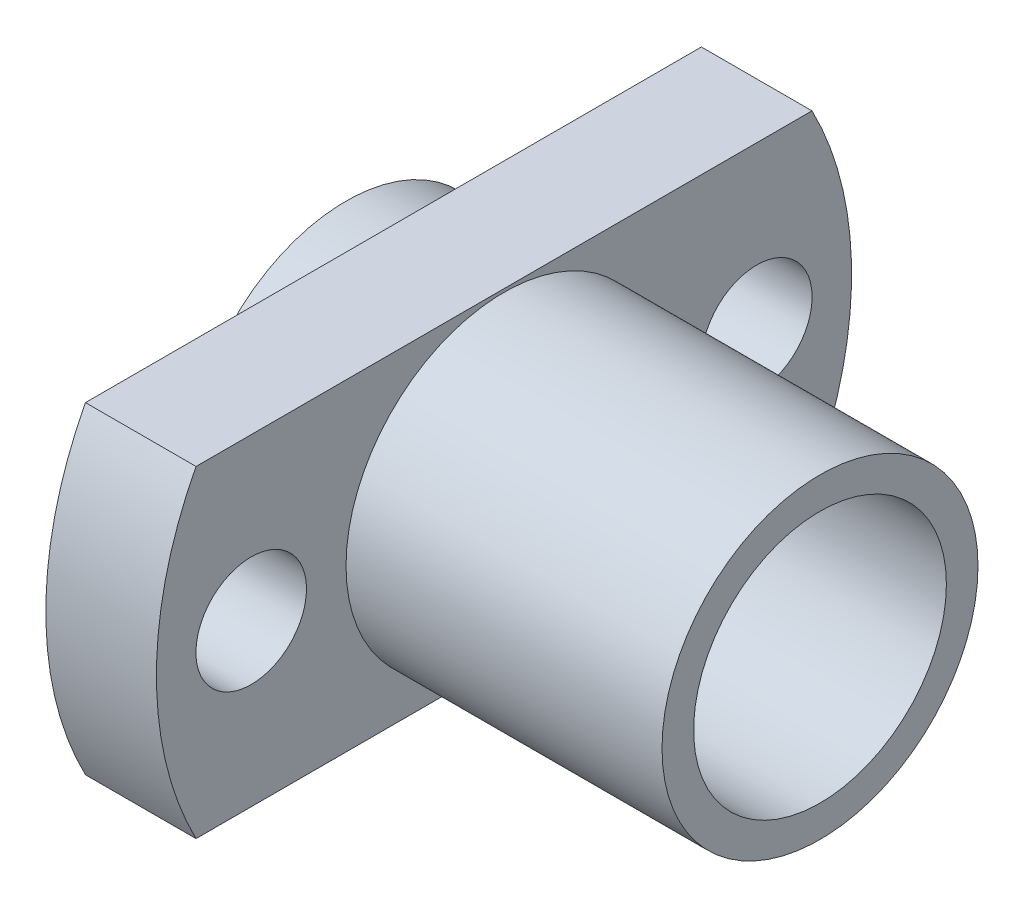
ISO-10303-21;
HEADER;
FILE_DESCRIPTION(('STEP AP214'),'2;1');
FILE_NAME('part.step','',(''),(''),'','','');
FILE_SCHEMA(('AUTOMOTIVE_DESIGN { 1 0 10303 214 1 1 1 1 }'));
ENDSEC;
DATA;
#1=APPLICATION_CONTEXT('core data for automotive mechanical design processes');
#2=APPLICATION_PROTOCOL_DEFINITION('international standard','automotive_design',2000,#1);
#3=PRODUCT_CONTEXT('',#1,'mechanical');
#4=PRODUCT('Part','Part','',(#3));
#5=PRODUCT_RELATED_PRODUCT_CATEGORY('part','',(#4));
#6=PRODUCT_DEFINITION_FORMATION('','',#4);
#7=PRODUCT_DEFINITION_CONTEXT('part definition',#1,'design');
#8=PRODUCT_DEFINITION('design','',#6,#7);
#9=PRODUCT_DEFINITION_SHAPE('','',#8);
#10=(LENGTH_UNIT() NAMED_UNIT(*) SI_UNIT(.MILLI.,.METRE.));
#11=(NAMED_UNIT(*) PLANE_ANGLE_UNIT() SI_UNIT($,.RADIAN.));
#12=(NAMED_UNIT(*) SI_UNIT($,.STERADIAN.) SOLID_ANGLE_UNIT());
#13=UNCERTAINTY_MEASURE_WITH_UNIT(LENGTH_MEASURE(1.E-05),#10,'distance_accuracy_value','');
#14=(GEOMETRIC_REPRESENTATION_CONTEXT(3) GLOBAL_UNCERTAINTY_ASSIGNED_CONTEXT((#13)) GLOBAL_UNIT_ASSIGNED_CONTEXT((#10,
#11,#12)) REPRESENTATION_CONTEXT('',''));
#15=CARTESIAN_POINT('',(0.,0.,0.));
#16=DIRECTION('',(0.,0.,1.));
#17=DIRECTION('',(1.,0.,0.));
#18=AXIS2_PLACEMENT_3D('',#15,#16,#17);
#19=CARTESIAN_POINT('',(5.,0.,0.));
#20=DIRECTION('',(1.,0.,0.));
#21=DIRECTION('',(0.,0.,-1.));
#22=AXIS2_PLACEMENT_3D('',#19,#20,#21);
#23=PLANE('',#22);
#24=CARTESIAN_POINT('',(5.,0.,-8.));
#25=DIRECTION('',(1.,0.,0.));
#26=DIRECTION('',(0.,0.,-1.));
#27=AXIS2_PLACEMENT_3D('',#24,#25,#26);
#28=CIRCLE('',#27,1.75);
#29=CARTESIAN_POINT('',(5.,0.,-9.75));
#30=VERTEX_POINT('',#29);
#31=EDGE_CURVE('E203',#30,#30,#28,.T.);
#32=ORIENTED_EDGE('',*,*,#31,.F.);
#33=EDGE_LOOP('',(#32));
#34=FACE_BOUND('',#33,.T.);
#35=CARTESIAN_POINT('',(5.,0.,0.));
#36=DIRECTION('',(1.,0.,0.));
#37=DIRECTION('',(0.,0.,-1.));
#38=AXIS2_PLACEMENT_3D('',#35,#36,#37);
#39=CIRCLE('',#38,11.);
#40=CARTESIAN_POINT('',(5.,5.1,9.74628134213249));
#41=VERTEX_POINT('',#40);
#42=CARTESIAN_POINT('',(5.,-5.1,9.74628134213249));
#43=VERTEX_POINT('',#42);
#44=EDGE_CURVE('E93',#41,#43,#39,.T.);
#45=ORIENTED_EDGE('',*,*,#44,.T.);
#46=DIRECTION('',(0.,0.,-1.));
#47=VECTOR('',#46,1.);
#48=CARTESIAN_POINT('',(5.,-5.1,9.74628134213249));
#49=LINE('',#48,#47);
#50=CARTESIAN_POINT('',(5.,-5.1,-9.74628134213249));
#51=VERTEX_POINT('',#50);
#52=EDGE_CURVE('E88',#43,#51,#49,.T.);
#53=ORIENTED_EDGE('',*,*,#52,.T.);
#54=CARTESIAN_POINT('',(5.,0.,0.));
#55=DIRECTION('',(1.,0.,0.));
#56=DIRECTION('',(0.,0.,-1.));
#57=AXIS2_PLACEMENT_3D('',#54,#55,#56);
#58=CIRCLE('',#57,11.);
#59=CARTESIAN_POINT('',(5.,5.1,-9.74628134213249));
#60=VERTEX_POINT('',#59);
#61=EDGE_CURVE('E91',#51,#60,#58,.T.);
#62=ORIENTED_EDGE('',*,*,#61,.T.);
#63=DIRECTION('',(0.,0.,1.));
#64=VECTOR('',#63,1.);
#65=CARTESIAN_POINT('',(5.,5.1,9.74628134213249));
#66=LINE('',#65,#64);
#67=EDGE_CURVE('E57',#60,#41,#66,.T.);
#68=ORIENTED_EDGE('',*,*,#67,.T.);
#69=EDGE_LOOP('',(#45,#53,#62,#68));
#70=FACE_BOUND('',#69,.T.);
#71=CARTESIAN_POINT('',(5.,0.,8.));
#72=DIRECTION('',(1.,0.,0.));
#73=DIRECTION('',(0.,0.,-1.));
#74=AXIS2_PLACEMENT_3D('',#71,#72,#73);
#75=CIRCLE('',#74,1.75);
#76=CARTESIAN_POINT('',(5.,0.,6.25));
#77=VERTEX_POINT('',#76);
#78=EDGE_CURVE('E116',#77,#77,#75,.T.);
#79=ORIENTED_EDGE('',*,*,#78,.F.);
#80=EDGE_LOOP('',(#79));
#81=FACE_BOUND('',#80,.T.);
#82=CARTESIAN_POINT('',(5.,0.,0.));
#83=DIRECTION('',(1.,0.,0.));
#84=DIRECTION('',(0.,0.,-1.));
#85=AXIS2_PLACEMENT_3D('',#82,#83,#84);
#86=CIRCLE('',#85,5.);
#87=CARTESIAN_POINT('',(5.,0.,-5.));
#88=VERTEX_POINT('',#87);
#89=EDGE_CURVE('E194',#88,#88,#86,.T.);
#90=ORIENTED_EDGE('',*,*,#89,.F.);
#91=EDGE_LOOP('',(#90));
#92=FACE_BOUND('',#91,.T.);
#93=ADVANCED_FACE('F39',(#34,#70,#81,#92),#23,.T.);
#94=CARTESIAN_POINT('',(0.,0.,0.));
#95=DIRECTION('',(1.,0.,0.));
#96=DIRECTION('',(0.,0.,-1.));
#97=AXIS2_PLACEMENT_3D('',#94,#95,#96);
#98=PLANE('',#97);
#99=CARTESIAN_POINT('',(0.,0.,0.));
#100=DIRECTION('',(1.,0.,0.));
#101=DIRECTION('',(0.,0.,-1.));
#102=AXIS2_PLACEMENT_3D('',#99,#100,#101);
#103=CIRCLE('',#102,5.);
#104=CARTESIAN_POINT('',(0.,0.,-5.));
#105=VERTEX_POINT('',#104);
#106=EDGE_CURVE('E43',#105,#105,#103,.T.);
#107=ORIENTED_EDGE('',*,*,#106,.F.);
#108=EDGE_LOOP('',(#107));
#109=FACE_BOUND('',#108,.T.);
#110=CARTESIAN_POINT('',(0.,0.,0.));
#111=DIRECTION('',(1.,0.,0.));
#112=DIRECTION('',(0.,0.,-1.));
#113=AXIS2_PLACEMENT_3D('',#110,#111,#112);
#114=CIRCLE('',#113,4.);
#115=CARTESIAN_POINT('',(0.,0.,-4.));
#116=VERTEX_POINT('',#115);
#117=EDGE_CURVE('E129',#116,#116,#114,.T.);
#118=ORIENTED_EDGE('',*,*,#117,.T.);
#119=EDGE_LOOP('',(#118));
#120=FACE_BOUND('',#119,.T.);
#121=ADVANCED_FACE('F139',(#109,#120),#98,.F.);
#122=CARTESIAN_POINT('',(1.5,0.,0.));
#123=DIRECTION('',(-1.,0.,0.));
#124=DIRECTION('',(0.,0.,1.));
#125=AXIS2_PLACEMENT_3D('',#122,#123,#124);
#126=CYLINDRICAL_SURFACE('',#125,5.);
#127=CARTESIAN_POINT('',(1.5,0.,0.));
#128=DIRECTION('',(1.,0.,0.));
#129=DIRECTION('',(0.,0.,-1.));
#130=AXIS2_PLACEMENT_3D('',#127,#128,#129);
#131=CIRCLE('',#130,5.);
#132=CARTESIAN_POINT('',(1.5,0.,-5.));
#133=VERTEX_POINT('',#132);
#134=EDGE_CURVE('E11',#133,#133,#131,.T.);
#135=ORIENTED_EDGE('',*,*,#134,.F.);
#136=EDGE_LOOP('',(#135));
#137=FACE_BOUND('',#136,.T.);
#138=ORIENTED_EDGE('',*,*,#106,.T.);
#139=EDGE_LOOP('',(#138));
#140=FACE_BOUND('',#139,.T.);
#141=ADVANCED_FACE('F41',(#137,#140),#126,.T.);
#142=CARTESIAN_POINT('',(1.5,0.,0.));
#143=DIRECTION('',(-1.,0.,0.));
#144=DIRECTION('',(0.,0.,1.));
#145=AXIS2_PLACEMENT_3D('',#142,#143,#144);
#146=CYLINDRICAL_SURFACE('',#145,4.);
#147=ORIENTED_EDGE('',*,*,#117,.F.);
#148=EDGE_LOOP('',(#147));
#149=FACE_BOUND('',#148,.T.);
#150=CARTESIAN_POINT('',(15.,0.,0.));
#151=DIRECTION('',(1.,0.,0.));
#152=DIRECTION('',(0.,0.,-1.));
#153=AXIS2_PLACEMENT_3D('',#150,#151,#152);
#154=CIRCLE('',#153,4.);
#155=CARTESIAN_POINT('',(15.,0.,-4.));
#156=VERTEX_POINT('',#155);
#157=EDGE_CURVE('E191',#156,#156,#154,.T.);
#158=ORIENTED_EDGE('',*,*,#157,.T.);
#159=EDGE_LOOP('',(#158));
#160=FACE_BOUND('',#159,.T.);
#161=ADVANCED_FACE('F145',(#149,#160),#146,.F.);
#162=CARTESIAN_POINT('',(1.5,0.,0.));
#163=DIRECTION('',(1.,0.,0.));
#164=DIRECTION('',(0.,0.,-1.));
#165=AXIS2_PLACEMENT_3D('',#162,#163,#164);
#166=PLANE('',#165);
#167=ORIENTED_EDGE('',*,*,#134,.T.);
#168=EDGE_LOOP('',(#167));
#169=FACE_BOUND('',#168,.T.);
#170=CARTESIAN_POINT('',(1.5,0.,0.));
#171=DIRECTION('',(1.,0.,0.));
#172=DIRECTION('',(0.,0.,-1.));
#173=AXIS2_PLACEMENT_3D('',#170,#171,#172);
#174=CIRCLE('',#173,11.);
#175=CARTESIAN_POINT('',(1.5,5.1,9.74628134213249));
#176=VERTEX_POINT('',#175);
#177=CARTESIAN_POINT('',(1.5,-5.1,9.74628134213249));
#178=VERTEX_POINT('',#177);
#179=EDGE_CURVE('E112',#176,#178,#174,.T.);
#180=ORIENTED_EDGE('',*,*,#179,.F.);
#181=DIRECTION('',(0.,0.,1.));
#182=VECTOR('',#181,1.);
#183=CARTESIAN_POINT('',(1.5,5.1,9.74628134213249));
#184=LINE('',#183,#182);
#185=CARTESIAN_POINT('',(1.5,5.1,-9.74628134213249));
#186=VERTEX_POINT('',#185);
#187=EDGE_CURVE('E80',#186,#176,#184,.T.);
#188=ORIENTED_EDGE('',*,*,#187,.F.);
#189=CARTESIAN_POINT('',(1.5,0.,0.));
#190=DIRECTION('',(1.,0.,0.));
#191=DIRECTION('',(0.,0.,-1.));
#192=AXIS2_PLACEMENT_3D('',#189,#190,#191);
#193=CIRCLE('',#192,11.);
#194=CARTESIAN_POINT('',(1.5,-5.1,-9.74628134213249));
#195=VERTEX_POINT('',#194);
#196=EDGE_CURVE('E74',#195,#186,#193,.T.);
#197=ORIENTED_EDGE('',*,*,#196,.F.);
#198=DIRECTION('',(0.,0.,-1.));
#199=VECTOR('',#198,1.);
#200=CARTESIAN_POINT('',(1.5,-5.1,9.74628134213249));
#201=LINE('',#200,#199);
#202=EDGE_CURVE('E99',#178,#195,#201,.T.);
#203=ORIENTED_EDGE('',*,*,#202,.F.);
#204=EDGE_LOOP('',(#180,#188,#197,#203));
#205=FACE_BOUND('',#204,.T.);
#206=CARTESIAN_POINT('',(1.5,0.,8.));
#207=DIRECTION('',(1.,0.,0.));
#208=DIRECTION('',(0.,0.,-1.));
#209=AXIS2_PLACEMENT_3D('',#206,#207,#208);
#210=CIRCLE('',#209,1.75);
#211=CARTESIAN_POINT('',(1.5,0.,6.25));
#212=VERTEX_POINT('',#211);
#213=EDGE_CURVE('E207',#212,#212,#210,.T.);
#214=ORIENTED_EDGE('',*,*,#213,.T.);
#215=EDGE_LOOP('',(#214));
#216=FACE_BOUND('',#215,.T.);
#217=CARTESIAN_POINT('',(1.5,0.,-8.));
#218=DIRECTION('',(1.,0.,0.));
#219=DIRECTION('',(0.,0.,-1.));
#220=AXIS2_PLACEMENT_3D('',#217,#218,#219);
#221=CIRCLE('',#220,1.75);
#222=CARTESIAN_POINT('',(1.5,0.,-9.75));
#223=VERTEX_POINT('',#222);
#224=EDGE_CURVE('E201',#223,#223,#221,.T.);
#225=ORIENTED_EDGE('',*,*,#224,.T.);
#226=EDGE_LOOP('',(#225));
#227=FACE_BOUND('',#226,.T.);
#228=ADVANCED_FACE('F152',(#169,#205,#216,#227),#166,.F.);
#229=CARTESIAN_POINT('',(5.,0.,0.));
#230=DIRECTION('',(-1.,0.,0.));
#231=DIRECTION('',(0.,0.,1.));
#232=AXIS2_PLACEMENT_3D('',#229,#230,#231);
#233=CYLINDRICAL_SURFACE('',#232,11.);
#234=ORIENTED_EDGE('',*,*,#179,.T.);
#235=DIRECTION('',(-1.,0.,0.));
#236=VECTOR('',#235,1.);
#237=CARTESIAN_POINT('',(5.,-5.1,9.74628134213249));
#238=LINE('',#237,#236);
#239=EDGE_CURVE('E101',#43,#178,#238,.T.);
#240=ORIENTED_EDGE('',*,*,#239,.F.);
#241=ORIENTED_EDGE('',*,*,#44,.F.);
#242=DIRECTION('',(-1.,0.,0.));
#243=VECTOR('',#242,1.);
#244=CARTESIAN_POINT('',(5.,5.1,9.74628134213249));
#245=LINE('',#244,#243);
#246=EDGE_CURVE('E108',#41,#176,#245,.T.);
#247=ORIENTED_EDGE('',*,*,#246,.T.);
#248=EDGE_LOOP('',(#234,#240,#241,#247));
#249=FACE_BOUND('',#248,.T.);
#250=ADVANCED_FACE('F154',(#249),#233,.T.);
#251=CARTESIAN_POINT('',(5.,-5.1,9.74628134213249));
#252=DIRECTION('',(0.,1.,0.));
#253=DIRECTION('',(0.,0.,1.));
#254=AXIS2_PLACEMENT_3D('',#251,#252,#253);
#255=PLANE('',#254);
#256=ORIENTED_EDGE('',*,*,#202,.T.);
#257=DIRECTION('',(-1.,0.,0.));
#258=VECTOR('',#257,1.);
#259=CARTESIAN_POINT('',(5.,-5.1,-9.74628134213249));
#260=LINE('',#259,#258);
#261=EDGE_CURVE('E97',#51,#195,#260,.T.);
#262=ORIENTED_EDGE('',*,*,#261,.F.);
#263=ORIENTED_EDGE('',*,*,#52,.F.);
#264=ORIENTED_EDGE('',*,*,#239,.T.);
#265=EDGE_LOOP('',(#256,#262,#263,#264));
#266=FACE_BOUND('',#265,.T.);
#267=ADVANCED_FACE('F98',(#266),#255,.F.);
#268=CARTESIAN_POINT('',(5.,0.,0.));
#269=DIRECTION('',(-1.,0.,0.));
#270=DIRECTION('',(0.,0.,1.));
#271=AXIS2_PLACEMENT_3D('',#268,#269,#270);
#272=CYLINDRICAL_SURFACE('',#271,11.);
#273=ORIENTED_EDGE('',*,*,#196,.T.);
#274=DIRECTION('',(-1.,0.,0.));
#275=VECTOR('',#274,1.);
#276=CARTESIAN_POINT('',(5.,5.1,-9.74628134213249));
#277=LINE('',#276,#275);
#278=EDGE_CURVE('E102',#60,#186,#277,.T.);
#279=ORIENTED_EDGE('',*,*,#278,.F.);
#280=ORIENTED_EDGE('',*,*,#61,.F.);
#281=ORIENTED_EDGE('',*,*,#261,.T.);
#282=EDGE_LOOP('',(#273,#279,#280,#281));
#283=FACE_BOUND('',#282,.T.);
#284=ADVANCED_FACE('F104',(#283),#272,.T.);
#285=CARTESIAN_POINT('',(5.,5.1,9.74628134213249));
#286=DIRECTION('',(0.,-1.,0.));
#287=DIRECTION('',(0.,0.,-1.));
#288=AXIS2_PLACEMENT_3D('',#285,#286,#287);
#289=PLANE('',#288);
#290=ORIENTED_EDGE('',*,*,#187,.T.);
#291=ORIENTED_EDGE('',*,*,#246,.F.);
#292=ORIENTED_EDGE('',*,*,#67,.F.);
#293=ORIENTED_EDGE('',*,*,#278,.T.);
#294=EDGE_LOOP('',(#290,#291,#292,#293));
#295=FACE_BOUND('',#294,.T.);
#296=ADVANCED_FACE('F162',(#295),#289,.F.);
#297=CARTESIAN_POINT('',(5.,0.,8.));
#298=DIRECTION('',(-1.,0.,0.));
#299=DIRECTION('',(0.,0.,1.));
#300=AXIS2_PLACEMENT_3D('',#297,#298,#299);
#301=CYLINDRICAL_SURFACE('',#300,1.75);
#302=ORIENTED_EDGE('',*,*,#78,.T.);
#303=EDGE_LOOP('',(#302));
#304=FACE_BOUND('',#303,.T.);
#305=ORIENTED_EDGE('',*,*,#213,.F.);
#306=EDGE_LOOP('',(#305));
#307=FACE_BOUND('',#306,.T.);
#308=ADVANCED_FACE('F165',(#304,#307),#301,.F.);
#309=CARTESIAN_POINT('',(5.,0.,-8.));
#310=DIRECTION('',(-1.,0.,0.));
#311=DIRECTION('',(0.,0.,1.));
#312=AXIS2_PLACEMENT_3D('',#309,#310,#311);
#313=CYLINDRICAL_SURFACE('',#312,1.75);
#314=ORIENTED_EDGE('',*,*,#31,.T.);
#315=EDGE_LOOP('',(#314));
#316=FACE_BOUND('',#315,.T.);
#317=ORIENTED_EDGE('',*,*,#224,.F.);
#318=EDGE_LOOP('',(#317));
#319=FACE_BOUND('',#318,.T.);
#320=ADVANCED_FACE('F171',(#316,#319),#313,.F.);
#321=CARTESIAN_POINT('',(15.,0.,0.));
#322=DIRECTION('',(1.,0.,0.));
#323=DIRECTION('',(0.,0.,-1.));
#324=AXIS2_PLACEMENT_3D('',#321,#322,#323);
#325=PLANE('',#324);
#326=CARTESIAN_POINT('',(15.,0.,0.));
#327=DIRECTION('',(1.,0.,0.));
#328=DIRECTION('',(0.,0.,-1.));
#329=AXIS2_PLACEMENT_3D('',#326,#327,#328);
#330=CIRCLE('',#329,5.);
#331=CARTESIAN_POINT('',(15.,0.,-5.));
#332=VERTEX_POINT('',#331);
#333=EDGE_CURVE('E188',#332,#332,#330,.T.);
#334=ORIENTED_EDGE('',*,*,#333,.T.);
#335=EDGE_LOOP('',(#334));
#336=FACE_BOUND('',#335,.T.);
#337=ORIENTED_EDGE('',*,*,#157,.F.);
#338=EDGE_LOOP('',(#337));
#339=FACE_BOUND('',#338,.T.);
#340=ADVANCED_FACE('F175',(#336,#339),#325,.T.);
#341=CARTESIAN_POINT('',(15.,0.,0.));
#342=DIRECTION('',(-1.,0.,0.));
#343=DIRECTION('',(0.,0.,1.));
#344=AXIS2_PLACEMENT_3D('',#341,#342,#343);
#345=CYLINDRICAL_SURFACE('',#344,5.);
#346=ORIENTED_EDGE('',*,*,#333,.F.);
#347=EDGE_LOOP('',(#346));
#348=FACE_BOUND('',#347,.T.);
#349=ORIENTED_EDGE('',*,*,#89,.T.);
#350=EDGE_LOOP('',(#349));
#351=FACE_BOUND('',#350,.T.);
#352=ADVANCED_FACE('F177',(#348,#351),#345,.T.);
#353=CLOSED_SHELL('',(#93,#121,#141,#161,#228,#250,#267,#284,#296,#308,#320,#340,#352));
#354=MANIFOLD_SOLID_BREP('B2',#353);
#355=ADVANCED_BREP_SHAPE_REPRESENTATION('',(#18,#354),#14);
#356=SHAPE_DEFINITION_REPRESENTATION(#9,#355);
ENDSEC;
END-ISO-10303-21;
